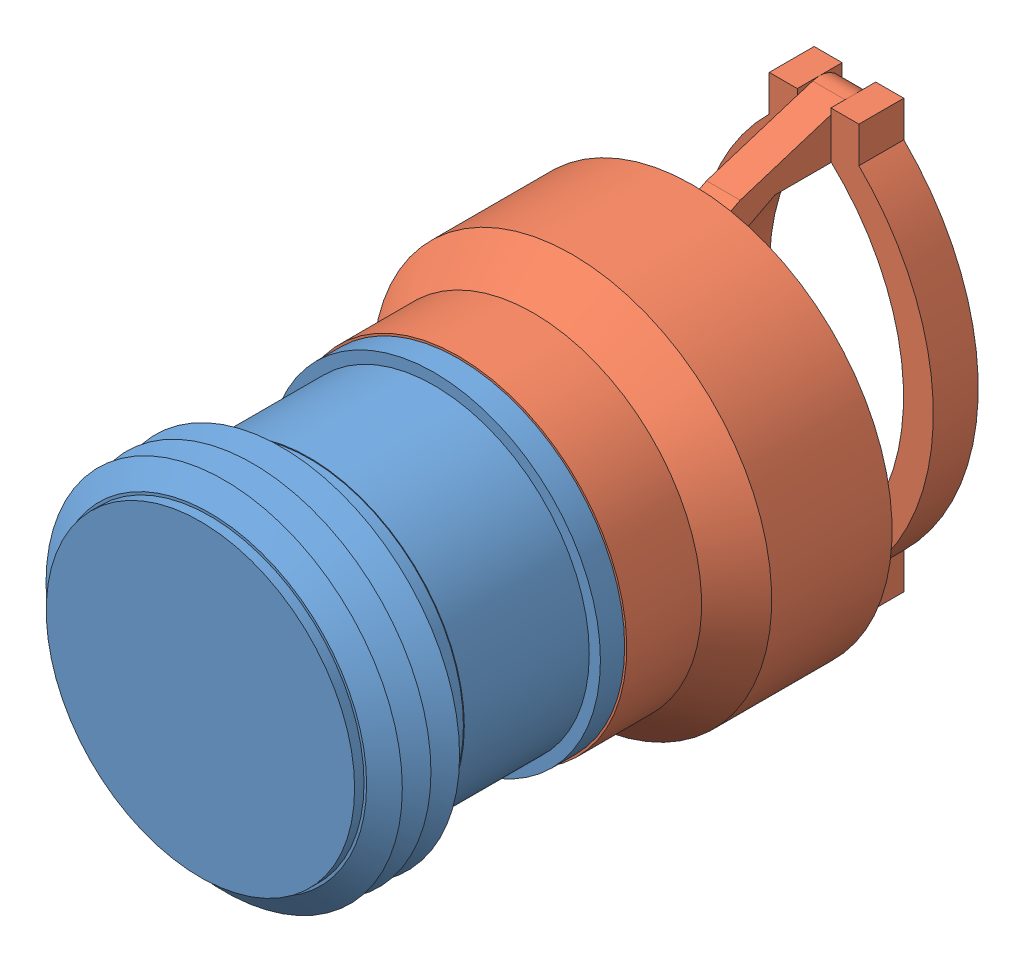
SolidWorks assembly LRAUV_Bus_Conn_ESP_Flying_Recp.SLDASM, configuration Default (file format 6000). Lengths in mm.
Overall size (35.56 38.1 58.79).
2 component instances, 2 part files, 2 mates.
Components (placement in the parent):
- Amphenol_TVP00RW-19-88S-1: Amphenol_TVP00RW-19-88S.SLDPRT [ESP Flying Mod] at (5.7468 20.7436 28.0452) size (31.75 31.75 34.9)
- Amphenol-StrainRelief-1: Amphenol-StrainRelief.SLDPRT [Default] at (5.7468 20.7436 25.8862) size (35.56 38.1 35.8)
Mates (geometry in assembly coordinates):
- Concentric1: concentric anti-aligned: cylinder of Amphenol_TVP00RW-19-88S-1 through (5.7468 20.7436 13.9736) axis (0 0 1) radius 13.296; cylinder of Amphenol-StrainRelief-1 through (5.7468 20.7436 25.8862) axis (0 0 -1) radius 15
- Distance1: distance = 2.159 mm aligned: plane of Amphenol_TVP00RW-19-88S-1 through (5.7468 20.7436 28.0452) normal (0 0 1); plane of Amphenol-StrainRelief-1 through (5.7468 32.5436 25.8862) normal (0 0 1)
